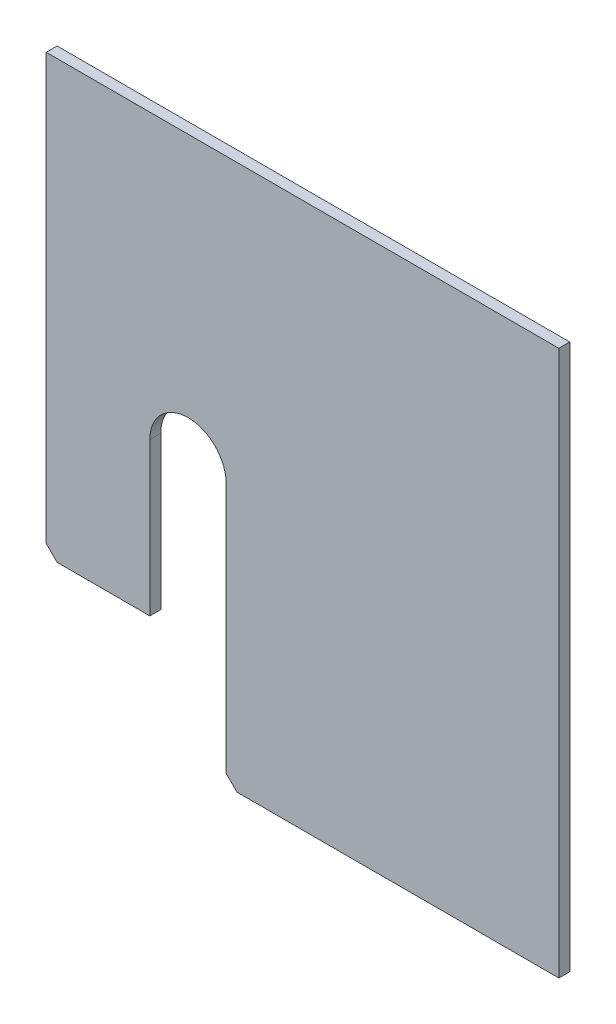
ISO-10303-21;
HEADER;
FILE_DESCRIPTION(('STEP AP214'),'2;1');
FILE_NAME('part.step','',(''),(''),'','','');
FILE_SCHEMA(('AUTOMOTIVE_DESIGN { 1 0 10303 214 1 1 1 1 }'));
ENDSEC;
DATA;
#1=APPLICATION_CONTEXT('core data for automotive mechanical design processes');
#2=APPLICATION_PROTOCOL_DEFINITION('international standard','automotive_design',2000,#1);
#3=PRODUCT_CONTEXT('',#1,'mechanical');
#4=PRODUCT('Part','Part','',(#3));
#5=PRODUCT_RELATED_PRODUCT_CATEGORY('part','',(#4));
#6=PRODUCT_DEFINITION_FORMATION('','',#4);
#7=PRODUCT_DEFINITION_CONTEXT('part definition',#1,'design');
#8=PRODUCT_DEFINITION('design','',#6,#7);
#9=PRODUCT_DEFINITION_SHAPE('','',#8);
#10=(LENGTH_UNIT() NAMED_UNIT(*) SI_UNIT(.MILLI.,.METRE.));
#11=(NAMED_UNIT(*) PLANE_ANGLE_UNIT() SI_UNIT($,.RADIAN.));
#12=(NAMED_UNIT(*) SI_UNIT($,.STERADIAN.) SOLID_ANGLE_UNIT());
#13=UNCERTAINTY_MEASURE_WITH_UNIT(LENGTH_MEASURE(1.E-05),#10,'distance_accuracy_value','');
#14=(GEOMETRIC_REPRESENTATION_CONTEXT(3) GLOBAL_UNCERTAINTY_ASSIGNED_CONTEXT((#13)) GLOBAL_UNIT_ASSIGNED_CONTEXT((#10,
#11,#12)) REPRESENTATION_CONTEXT('',''));
#15=CARTESIAN_POINT('',(0.,0.,0.));
#16=DIRECTION('',(0.,0.,1.));
#17=DIRECTION('',(1.,0.,0.));
#18=AXIS2_PLACEMENT_3D('',#15,#16,#17);
#19=CARTESIAN_POINT('',(10.,100.,10.));
#20=DIRECTION('',(0.707106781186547,0.707106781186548,0.));
#21=DIRECTION('',(-0.707106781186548,0.707106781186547,0.));
#22=AXIS2_PLACEMENT_3D('',#19,#20,#21);
#23=PLANE('',#22);
#24=DIRECTION('',(0.707106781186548,-0.707106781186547,0.));
#25=VECTOR('',#24,1.);
#26=CARTESIAN_POINT('',(10.,100.,0.));
#27=LINE('',#26,#25);
#28=CARTESIAN_POINT('',(0.,110.,0.));
#29=VERTEX_POINT('',#28);
#30=CARTESIAN_POINT('',(10.,100.,0.));
#31=VERTEX_POINT('',#30);
#32=EDGE_CURVE('E139',#29,#31,#27,.T.);
#33=ORIENTED_EDGE('',*,*,#32,.T.);
#34=DIRECTION('',(0.,0.,-1.));
#35=VECTOR('',#34,1.);
#36=CARTESIAN_POINT('',(10.,100.,10.));
#37=LINE('',#36,#35);
#38=CARTESIAN_POINT('',(10.,100.,10.));
#39=VERTEX_POINT('',#38);
#40=EDGE_CURVE('E11',#39,#31,#37,.T.);
#41=ORIENTED_EDGE('',*,*,#40,.F.);
#42=DIRECTION('',(0.707106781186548,-0.707106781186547,0.));
#43=VECTOR('',#42,1.);
#44=CARTESIAN_POINT('',(10.,100.,10.));
#45=LINE('',#44,#43);
#46=CARTESIAN_POINT('',(0.,110.,10.));
#47=VERTEX_POINT('',#46);
#48=EDGE_CURVE('E157',#47,#39,#45,.T.);
#49=ORIENTED_EDGE('',*,*,#48,.F.);
#50=DIRECTION('',(0.,0.,-1.));
#51=VECTOR('',#50,1.);
#52=CARTESIAN_POINT('',(0.,110.,10.));
#53=LINE('',#52,#51);
#54=EDGE_CURVE('E135',#47,#29,#53,.T.);
#55=ORIENTED_EDGE('',*,*,#54,.T.);
#56=EDGE_LOOP('',(#33,#41,#49,#55));
#57=FACE_BOUND('',#56,.T.);
#58=ADVANCED_FACE('F31',(#57),#23,.F.);
#59=CARTESIAN_POINT('',(10.,100.,10.));
#60=DIRECTION('',(0.,1.,0.));
#61=DIRECTION('',(0.,0.,1.));
#62=AXIS2_PLACEMENT_3D('',#59,#60,#61);
#63=PLANE('',#62);
#64=DIRECTION('',(1.,0.,0.));
#65=VECTOR('',#64,1.);
#66=CARTESIAN_POINT('',(10.,100.,0.));
#67=LINE('',#66,#65);
#68=CARTESIAN_POINT('',(95.,100.,0.));
#69=VERTEX_POINT('',#68);
#70=EDGE_CURVE('E142',#31,#69,#67,.T.);
#71=ORIENTED_EDGE('',*,*,#70,.T.);
#72=DIRECTION('',(0.,0.,-1.));
#73=VECTOR('',#72,1.);
#74=CARTESIAN_POINT('',(95.,100.,10.));
#75=LINE('',#74,#73);
#76=CARTESIAN_POINT('',(95.,100.,10.));
#77=VERTEX_POINT('',#76);
#78=EDGE_CURVE('E39',#77,#69,#75,.T.);
#79=ORIENTED_EDGE('',*,*,#78,.F.);
#80=DIRECTION('',(1.,0.,0.));
#81=VECTOR('',#80,1.);
#82=CARTESIAN_POINT('',(10.,100.,10.));
#83=LINE('',#82,#81);
#84=EDGE_CURVE('E96',#39,#77,#83,.T.);
#85=ORIENTED_EDGE('',*,*,#84,.F.);
#86=ORIENTED_EDGE('',*,*,#40,.T.);
#87=EDGE_LOOP('',(#71,#79,#85,#86));
#88=FACE_BOUND('',#87,.T.);
#89=ADVANCED_FACE('F206',(#88),#63,.F.);
#90=CARTESIAN_POINT('',(95.,100.,10.));
#91=DIRECTION('',(-1.,0.,0.));
#92=DIRECTION('',(0.,0.,1.));
#93=AXIS2_PLACEMENT_3D('',#90,#91,#92);
#94=PLANE('',#93);
#95=DIRECTION('',(0.,1.,0.));
#96=VECTOR('',#95,1.);
#97=CARTESIAN_POINT('',(95.,100.,0.));
#98=LINE('',#97,#96);
#99=CARTESIAN_POINT('',(95.,240.,0.));
#100=VERTEX_POINT('',#99);
#101=EDGE_CURVE('E144',#69,#100,#98,.T.);
#102=ORIENTED_EDGE('',*,*,#101,.T.);
#103=DIRECTION('',(0.,0.,-1.));
#104=VECTOR('',#103,1.);
#105=CARTESIAN_POINT('',(95.,240.,10.));
#106=LINE('',#105,#104);
#107=CARTESIAN_POINT('',(95.,240.,10.));
#108=VERTEX_POINT('',#107);
#109=EDGE_CURVE('E170',#108,#100,#106,.T.);
#110=ORIENTED_EDGE('',*,*,#109,.F.);
#111=DIRECTION('',(0.,1.,0.));
#112=VECTOR('',#111,1.);
#113=CARTESIAN_POINT('',(95.,100.,10.));
#114=LINE('',#113,#112);
#115=EDGE_CURVE('E178',#77,#108,#114,.T.);
#116=ORIENTED_EDGE('',*,*,#115,.F.);
#117=ORIENTED_EDGE('',*,*,#78,.T.);
#118=EDGE_LOOP('',(#102,#110,#116,#117));
#119=FACE_BOUND('',#118,.T.);
#120=ADVANCED_FACE('F176',(#119),#94,.F.);
#121=CARTESIAN_POINT('',(130.,240.,10.));
#122=DIRECTION('',(0.,0.,-1.));
#123=DIRECTION('',(-1.,0.,0.));
#124=AXIS2_PLACEMENT_3D('',#121,#122,#123);
#125=CYLINDRICAL_SURFACE('',#124,35.);
#126=CARTESIAN_POINT('',(130.,240.,0.));
#127=DIRECTION('',(0.,0.,-1.));
#128=DIRECTION('',(1.,0.,0.));
#129=AXIS2_PLACEMENT_3D('',#126,#127,#128);
#130=CIRCLE('',#129,35.);
#131=CARTESIAN_POINT('',(165.,240.,0.));
#132=VERTEX_POINT('',#131);
#133=EDGE_CURVE('E146',#100,#132,#130,.T.);
#134=ORIENTED_EDGE('',*,*,#133,.T.);
#135=DIRECTION('',(0.,0.,-1.));
#136=VECTOR('',#135,1.);
#137=CARTESIAN_POINT('',(165.,240.,10.));
#138=LINE('',#137,#136);
#139=CARTESIAN_POINT('',(165.,240.,10.));
#140=VERTEX_POINT('',#139);
#141=EDGE_CURVE('E167',#140,#132,#138,.T.);
#142=ORIENTED_EDGE('',*,*,#141,.F.);
#143=CARTESIAN_POINT('',(130.,240.,10.));
#144=DIRECTION('',(0.,0.,-1.));
#145=DIRECTION('',(1.,0.,0.));
#146=AXIS2_PLACEMENT_3D('',#143,#144,#145);
#147=CIRCLE('',#146,35.);
#148=EDGE_CURVE('E196',#108,#140,#147,.T.);
#149=ORIENTED_EDGE('',*,*,#148,.F.);
#150=ORIENTED_EDGE('',*,*,#109,.T.);
#151=EDGE_LOOP('',(#134,#142,#149,#150));
#152=FACE_BOUND('',#151,.T.);
#153=ADVANCED_FACE('F187',(#152),#125,.F.);
#154=CARTESIAN_POINT('',(165.,240.,10.));
#155=DIRECTION('',(1.,0.,0.));
#156=DIRECTION('',(0.,1.,0.));
#157=AXIS2_PLACEMENT_3D('',#154,#155,#156);
#158=PLANE('',#157);
#159=DIRECTION('',(0.,-1.,0.));
#160=VECTOR('',#159,1.);
#161=CARTESIAN_POINT('',(165.,240.,0.));
#162=LINE('',#161,#160);
#163=CARTESIAN_POINT('',(165.,10.,0.));
#164=VERTEX_POINT('',#163);
#165=EDGE_CURVE('E148',#132,#164,#162,.T.);
#166=ORIENTED_EDGE('',*,*,#165,.T.);
#167=DIRECTION('',(0.,0.,-1.));
#168=VECTOR('',#167,1.);
#169=CARTESIAN_POINT('',(165.,10.,10.));
#170=LINE('',#169,#168);
#171=CARTESIAN_POINT('',(165.,10.,10.));
#172=VERTEX_POINT('',#171);
#173=EDGE_CURVE('E164',#172,#164,#170,.T.);
#174=ORIENTED_EDGE('',*,*,#173,.F.);
#175=DIRECTION('',(0.,-1.,0.));
#176=VECTOR('',#175,1.);
#177=CARTESIAN_POINT('',(165.,240.,10.));
#178=LINE('',#177,#176);
#179=EDGE_CURVE('E193',#140,#172,#178,.T.);
#180=ORIENTED_EDGE('',*,*,#179,.F.);
#181=ORIENTED_EDGE('',*,*,#141,.T.);
#182=EDGE_LOOP('',(#166,#174,#180,#181));
#183=FACE_BOUND('',#182,.T.);
#184=ADVANCED_FACE('F191',(#183),#158,.F.);
#185=CARTESIAN_POINT('',(165.,10.,10.));
#186=DIRECTION('',(0.707106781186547,0.707106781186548,0.));
#187=DIRECTION('',(-0.707106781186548,0.707106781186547,0.));
#188=AXIS2_PLACEMENT_3D('',#185,#186,#187);
#189=PLANE('',#188);
#190=DIRECTION('',(0.707106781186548,-0.707106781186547,0.));
#191=VECTOR('',#190,1.);
#192=CARTESIAN_POINT('',(165.,10.,0.));
#193=LINE('',#192,#191);
#194=CARTESIAN_POINT('',(175.,0.,0.));
#195=VERTEX_POINT('',#194);
#196=EDGE_CURVE('E150',#164,#195,#193,.T.);
#197=ORIENTED_EDGE('',*,*,#196,.T.);
#198=DIRECTION('',(0.,0.,-1.));
#199=VECTOR('',#198,1.);
#200=CARTESIAN_POINT('',(175.,0.,10.));
#201=LINE('',#200,#199);
#202=CARTESIAN_POINT('',(175.,0.,10.));
#203=VERTEX_POINT('',#202);
#204=EDGE_CURVE('E161',#203,#195,#201,.T.);
#205=ORIENTED_EDGE('',*,*,#204,.F.);
#206=DIRECTION('',(0.707106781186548,-0.707106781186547,0.));
#207=VECTOR('',#206,1.);
#208=CARTESIAN_POINT('',(165.,10.,10.));
#209=LINE('',#208,#207);
#210=EDGE_CURVE('E195',#172,#203,#209,.T.);
#211=ORIENTED_EDGE('',*,*,#210,.F.);
#212=ORIENTED_EDGE('',*,*,#173,.T.);
#213=EDGE_LOOP('',(#197,#205,#211,#212));
#214=FACE_BOUND('',#213,.T.);
#215=ADVANCED_FACE('F218',(#214),#189,.F.);
#216=CARTESIAN_POINT('',(175.,0.,10.));
#217=DIRECTION('',(0.,1.,0.));
#218=DIRECTION('',(0.,0.,1.));
#219=AXIS2_PLACEMENT_3D('',#216,#217,#218);
#220=PLANE('',#219);
#221=DIRECTION('',(1.,0.,0.));
#222=VECTOR('',#221,1.);
#223=CARTESIAN_POINT('',(175.,0.,0.));
#224=LINE('',#223,#222);
#225=CARTESIAN_POINT('',(470.,0.,0.));
#226=VERTEX_POINT('',#225);
#227=EDGE_CURVE('E152',#195,#226,#224,.T.);
#228=ORIENTED_EDGE('',*,*,#227,.T.);
#229=DIRECTION('',(0.,0.,-1.));
#230=VECTOR('',#229,1.);
#231=CARTESIAN_POINT('',(470.,0.,10.));
#232=LINE('',#231,#230);
#233=CARTESIAN_POINT('',(470.,0.,10.));
#234=VERTEX_POINT('',#233);
#235=EDGE_CURVE('E130',#234,#226,#232,.T.);
#236=ORIENTED_EDGE('',*,*,#235,.F.);
#237=DIRECTION('',(1.,0.,0.));
#238=VECTOR('',#237,1.);
#239=CARTESIAN_POINT('',(175.,0.,10.));
#240=LINE('',#239,#238);
#241=EDGE_CURVE('E121',#203,#234,#240,.T.);
#242=ORIENTED_EDGE('',*,*,#241,.F.);
#243=ORIENTED_EDGE('',*,*,#204,.T.);
#244=EDGE_LOOP('',(#228,#236,#242,#243));
#245=FACE_BOUND('',#244,.T.);
#246=ADVANCED_FACE('F221',(#245),#220,.F.);
#247=CARTESIAN_POINT('',(470.,0.,10.));
#248=DIRECTION('',(-1.,0.,0.));
#249=DIRECTION('',(0.,0.,1.));
#250=AXIS2_PLACEMENT_3D('',#247,#248,#249);
#251=PLANE('',#250);
#252=DIRECTION('',(0.,1.,0.));
#253=VECTOR('',#252,1.);
#254=CARTESIAN_POINT('',(470.,0.,0.));
#255=LINE('',#254,#253);
#256=CARTESIAN_POINT('',(470.,500.,0.));
#257=VERTEX_POINT('',#256);
#258=EDGE_CURVE('E129',#226,#257,#255,.T.);
#259=ORIENTED_EDGE('',*,*,#258,.T.);
#260=DIRECTION('',(0.,0.,-1.));
#261=VECTOR('',#260,1.);
#262=CARTESIAN_POINT('',(470.,500.,10.));
#263=LINE('',#262,#261);
#264=CARTESIAN_POINT('',(470.,500.,10.));
#265=VERTEX_POINT('',#264);
#266=EDGE_CURVE('E126',#265,#257,#263,.T.);
#267=ORIENTED_EDGE('',*,*,#266,.F.);
#268=DIRECTION('',(0.,1.,0.));
#269=VECTOR('',#268,1.);
#270=CARTESIAN_POINT('',(470.,0.,10.));
#271=LINE('',#270,#269);
#272=EDGE_CURVE('E115',#234,#265,#271,.T.);
#273=ORIENTED_EDGE('',*,*,#272,.F.);
#274=ORIENTED_EDGE('',*,*,#235,.T.);
#275=EDGE_LOOP('',(#259,#267,#273,#274));
#276=FACE_BOUND('',#275,.T.);
#277=ADVANCED_FACE('F127',(#276),#251,.F.);
#278=CARTESIAN_POINT('',(0.,500.,10.));
#279=DIRECTION('',(0.,-1.,0.));
#280=DIRECTION('',(0.,0.,-1.));
#281=AXIS2_PLACEMENT_3D('',#278,#279,#280);
#282=PLANE('',#281);
#283=DIRECTION('',(-1.,0.,0.));
#284=VECTOR('',#283,1.);
#285=CARTESIAN_POINT('',(0.,500.,0.));
#286=LINE('',#285,#284);
#287=CARTESIAN_POINT('',(0.,500.,0.));
#288=VERTEX_POINT('',#287);
#289=EDGE_CURVE('E82',#257,#288,#286,.T.);
#290=ORIENTED_EDGE('',*,*,#289,.T.);
#291=DIRECTION('',(0.,0.,-1.));
#292=VECTOR('',#291,1.);
#293=CARTESIAN_POINT('',(0.,500.,10.));
#294=LINE('',#293,#292);
#295=CARTESIAN_POINT('',(0.,500.,10.));
#296=VERTEX_POINT('',#295);
#297=EDGE_CURVE('E131',#296,#288,#294,.T.);
#298=ORIENTED_EDGE('',*,*,#297,.F.);
#299=DIRECTION('',(-1.,0.,0.));
#300=VECTOR('',#299,1.);
#301=CARTESIAN_POINT('',(0.,500.,10.));
#302=LINE('',#301,#300);
#303=EDGE_CURVE('E119',#265,#296,#302,.T.);
#304=ORIENTED_EDGE('',*,*,#303,.F.);
#305=ORIENTED_EDGE('',*,*,#266,.T.);
#306=EDGE_LOOP('',(#290,#298,#304,#305));
#307=FACE_BOUND('',#306,.T.);
#308=ADVANCED_FACE('F133',(#307),#282,.F.);
#309=CARTESIAN_POINT('',(0.,110.,10.));
#310=DIRECTION('',(1.,0.,0.));
#311=DIRECTION('',(0.,0.,-1.));
#312=AXIS2_PLACEMENT_3D('',#309,#310,#311);
#313=PLANE('',#312);
#314=DIRECTION('',(0.,-1.,0.));
#315=VECTOR('',#314,1.);
#316=CARTESIAN_POINT('',(0.,110.,0.));
#317=LINE('',#316,#315);
#318=EDGE_CURVE('E88',#288,#29,#317,.T.);
#319=ORIENTED_EDGE('',*,*,#318,.T.);
#320=ORIENTED_EDGE('',*,*,#54,.F.);
#321=DIRECTION('',(0.,-1.,0.));
#322=VECTOR('',#321,1.);
#323=CARTESIAN_POINT('',(0.,110.,10.));
#324=LINE('',#323,#322);
#325=EDGE_CURVE('E47',#296,#47,#324,.T.);
#326=ORIENTED_EDGE('',*,*,#325,.F.);
#327=ORIENTED_EDGE('',*,*,#297,.T.);
#328=EDGE_LOOP('',(#319,#320,#326,#327));
#329=FACE_BOUND('',#328,.T.);
#330=ADVANCED_FACE('F230',(#329),#313,.F.);
#331=CARTESIAN_POINT('',(130.,240.,10.));
#332=DIRECTION('',(0.,0.,1.));
#333=DIRECTION('',(1.,0.,0.));
#334=AXIS2_PLACEMENT_3D('',#331,#332,#333);
#335=PLANE('',#334);
#336=ORIENTED_EDGE('',*,*,#48,.T.);
#337=ORIENTED_EDGE('',*,*,#84,.T.);
#338=ORIENTED_EDGE('',*,*,#115,.T.);
#339=ORIENTED_EDGE('',*,*,#148,.T.);
#340=ORIENTED_EDGE('',*,*,#179,.T.);
#341=ORIENTED_EDGE('',*,*,#210,.T.);
#342=ORIENTED_EDGE('',*,*,#241,.T.);
#343=ORIENTED_EDGE('',*,*,#272,.T.);
#344=ORIENTED_EDGE('',*,*,#303,.T.);
#345=ORIENTED_EDGE('',*,*,#325,.T.);
#346=EDGE_LOOP('',(#336,#337,#338,#339,#340,#341,#342,#343,#344,#345));
#347=FACE_BOUND('',#346,.T.);
#348=ADVANCED_FACE('F117',(#347),#335,.T.);
#349=CARTESIAN_POINT('',(130.,240.,0.));
#350=DIRECTION('',(0.,0.,1.));
#351=DIRECTION('',(1.,0.,0.));
#352=AXIS2_PLACEMENT_3D('',#349,#350,#351);
#353=PLANE('',#352);
#354=ORIENTED_EDGE('',*,*,#32,.F.);
#355=ORIENTED_EDGE('',*,*,#318,.F.);
#356=ORIENTED_EDGE('',*,*,#289,.F.);
#357=ORIENTED_EDGE('',*,*,#258,.F.);
#358=ORIENTED_EDGE('',*,*,#227,.F.);
#359=ORIENTED_EDGE('',*,*,#196,.F.);
#360=ORIENTED_EDGE('',*,*,#165,.F.);
#361=ORIENTED_EDGE('',*,*,#133,.F.);
#362=ORIENTED_EDGE('',*,*,#101,.F.);
#363=ORIENTED_EDGE('',*,*,#70,.F.);
#364=EDGE_LOOP('',(#354,#355,#356,#357,#358,#359,#360,#361,#362,#363));
#365=FACE_BOUND('',#364,.T.);
#366=ADVANCED_FACE('F182',(#365),#353,.F.);
#367=CLOSED_SHELL('',(#58,#89,#120,#153,#184,#215,#246,#277,#308,#330,#348,#366));
#368=MANIFOLD_SOLID_BREP('B2',#367);
#369=ADVANCED_BREP_SHAPE_REPRESENTATION('',(#18,#368),#14);
#370=SHAPE_DEFINITION_REPRESENTATION(#9,#369);
ENDSEC;
END-ISO-10303-21;
